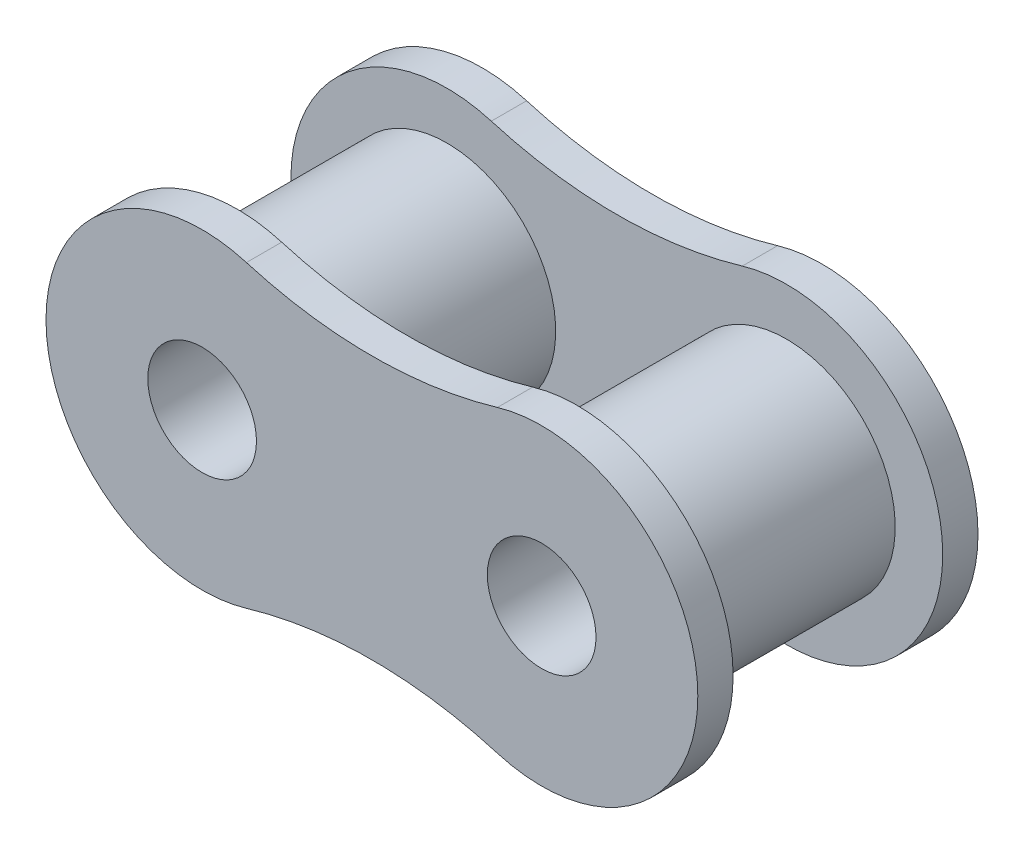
ISO-10303-21;
HEADER;
FILE_DESCRIPTION(('STEP AP214'),'2;1');
FILE_NAME('part.step','',(''),(''),'','','');
FILE_SCHEMA(('AUTOMOTIVE_DESIGN { 1 0 10303 214 1 1 1 1 }'));
ENDSEC;
DATA;
#1=APPLICATION_CONTEXT('core data for automotive mechanical design processes');
#2=APPLICATION_PROTOCOL_DEFINITION('international standard','automotive_design',2000,#1);
#3=PRODUCT_CONTEXT('',#1,'mechanical');
#4=PRODUCT('Part','Part','',(#3));
#5=PRODUCT_RELATED_PRODUCT_CATEGORY('part','',(#4));
#6=PRODUCT_DEFINITION_FORMATION('','',#4);
#7=PRODUCT_DEFINITION_CONTEXT('part definition',#1,'design');
#8=PRODUCT_DEFINITION('design','',#6,#7);
#9=PRODUCT_DEFINITION_SHAPE('','',#8);
#10=(LENGTH_UNIT() NAMED_UNIT(*) SI_UNIT(.MILLI.,.METRE.));
#11=(NAMED_UNIT(*) PLANE_ANGLE_UNIT() SI_UNIT($,.RADIAN.));
#12=(NAMED_UNIT(*) SI_UNIT($,.STERADIAN.) SOLID_ANGLE_UNIT());
#13=UNCERTAINTY_MEASURE_WITH_UNIT(LENGTH_MEASURE(1.E-05),#10,'distance_accuracy_value','');
#14=(GEOMETRIC_REPRESENTATION_CONTEXT(3) GLOBAL_UNCERTAINTY_ASSIGNED_CONTEXT((#13)) GLOBAL_UNIT_ASSIGNED_CONTEXT((#10,
#11,#12)) REPRESENTATION_CONTEXT('',''));
#15=CARTESIAN_POINT('',(0.,0.,0.));
#16=DIRECTION('',(0.,0.,1.));
#17=DIRECTION('',(1.,0.,0.));
#18=AXIS2_PLACEMENT_3D('',#15,#16,#17);
#19=CARTESIAN_POINT('',(-3.96875,13.4204712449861,4.9));
#20=DIRECTION('',(0.,0.,1.));
#21=DIRECTION('',(1.,0.,0.));
#22=AXIS2_PLACEMENT_3D('',#19,#20,#21);
#23=PLANE('',#22);
#24=CARTESIAN_POINT('',(0.,0.,4.9));
#25=DIRECTION('',(0.,0.,1.));
#26=DIRECTION('',(1.,0.,0.));
#27=AXIS2_PLACEMENT_3D('',#24,#25,#26);
#28=CIRCLE('',#27,5.08);
#29=CARTESIAN_POINT('',(5.08,0.,4.9));
#30=VERTEX_POINT('',#29);
#31=EDGE_CURVE('E42',#30,#30,#28,.T.);
#32=ORIENTED_EDGE('',*,*,#31,.T.);
#33=EDGE_LOOP('',(#32));
#34=FACE_BOUND('',#33,.T.);
#35=CARTESIAN_POINT('',(-7.9375,26.8409424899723,4.9));
#36=DIRECTION('',(0.,0.,-1.));
#37=DIRECTION('',(1.,0.,0.));
#38=AXIS2_PLACEMENT_3D('',#35,#36,#37);
#39=CIRCLE('',#38,20.69);
#40=CARTESIAN_POINT('',(-2.07015898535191,7.00031726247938,4.9));
#41=VERTEX_POINT('',#40);
#42=CARTESIAN_POINT('',(-13.8048410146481,7.00031726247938,4.9));
#43=VERTEX_POINT('',#42);
#44=EDGE_CURVE('E152',#41,#43,#39,.T.);
#45=ORIENTED_EDGE('',*,*,#44,.F.);
#46=CARTESIAN_POINT('',(0.,0.,4.9));
#47=DIRECTION('',(0.,0.,1.));
#48=DIRECTION('',(1.,0.,0.));
#49=AXIS2_PLACEMENT_3D('',#46,#47,#48);
#50=CIRCLE('',#49,7.3);
#51=CARTESIAN_POINT('',(-2.07015898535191,-7.00031726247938,4.9));
#52=VERTEX_POINT('',#51);
#53=EDGE_CURVE('E74',#52,#41,#50,.T.);
#54=ORIENTED_EDGE('',*,*,#53,.F.);
#55=CARTESIAN_POINT('',(-7.9375,-26.8409424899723,4.9));
#56=DIRECTION('',(0.,0.,-1.));
#57=DIRECTION('',(-1.,0.,0.));
#58=AXIS2_PLACEMENT_3D('',#55,#56,#57);
#59=CIRCLE('',#58,20.69);
#60=CARTESIAN_POINT('',(-13.8048410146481,-7.00031726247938,4.9));
#61=VERTEX_POINT('',#60);
#62=EDGE_CURVE('E68',#61,#52,#59,.T.);
#63=ORIENTED_EDGE('',*,*,#62,.F.);
#64=CARTESIAN_POINT('',(-15.875,0.,4.9));
#65=DIRECTION('',(0.,0.,1.));
#66=DIRECTION('',(1.,0.,0.));
#67=AXIS2_PLACEMENT_3D('',#64,#65,#66);
#68=CIRCLE('',#67,7.3);
#69=EDGE_CURVE('E162',#43,#61,#68,.T.);
#70=ORIENTED_EDGE('',*,*,#69,.F.);
#71=EDGE_LOOP('',(#45,#54,#63,#70));
#72=FACE_BOUND('',#71,.T.);
#73=CARTESIAN_POINT('',(-15.875,0.,4.9));
#74=DIRECTION('',(0.,0.,1.));
#75=DIRECTION('',(1.,0.,0.));
#76=AXIS2_PLACEMENT_3D('',#73,#74,#75);
#77=CIRCLE('',#76,5.08);
#78=CARTESIAN_POINT('',(-10.795,0.,4.9));
#79=VERTEX_POINT('',#78);
#80=EDGE_CURVE('E11',#79,#79,#77,.F.);
#81=ORIENTED_EDGE('',*,*,#80,.F.);
#82=EDGE_LOOP('',(#81));
#83=FACE_BOUND('',#82,.T.);
#84=ADVANCED_FACE('F33',(#34,#72,#83),#23,.F.);
#85=CARTESIAN_POINT('',(0.,0.,4.9));
#86=DIRECTION('',(0.,0.,-1.));
#87=DIRECTION('',(-1.,0.,0.));
#88=AXIS2_PLACEMENT_3D('',#85,#86,#87);
#89=CYLINDRICAL_SURFACE('',#88,5.08);
#90=ORIENTED_EDGE('',*,*,#31,.F.);
#91=EDGE_LOOP('',(#90));
#92=FACE_BOUND('',#91,.T.);
#93=CARTESIAN_POINT('',(0.,0.,-4.9));
#94=DIRECTION('',(0.,0.,-1.));
#95=DIRECTION('',(-1.,0.,0.));
#96=AXIS2_PLACEMENT_3D('',#93,#94,#95);
#97=CIRCLE('',#96,5.08);
#98=CARTESIAN_POINT('',(-5.08,0.,-4.9));
#99=VERTEX_POINT('',#98);
#100=EDGE_CURVE('E138',#99,#99,#97,.T.);
#101=ORIENTED_EDGE('',*,*,#100,.F.);
#102=EDGE_LOOP('',(#101));
#103=FACE_BOUND('',#102,.T.);
#104=ADVANCED_FACE('F35',(#92,#103),#89,.T.);
#105=CARTESIAN_POINT('',(0.,0.,4.9));
#106=DIRECTION('',(0.,0.,-1.));
#107=DIRECTION('',(-1.,0.,0.));
#108=AXIS2_PLACEMENT_3D('',#105,#106,#107);
#109=CYLINDRICAL_SURFACE('',#108,2.54);
#110=CARTESIAN_POINT('',(0.,0.,6.55));
#111=DIRECTION('',(0.,0.,1.));
#112=DIRECTION('',(1.,0.,0.));
#113=AXIS2_PLACEMENT_3D('',#110,#111,#112);
#114=CIRCLE('',#113,2.54);
#115=CARTESIAN_POINT('',(2.54,0.,6.55));
#116=VERTEX_POINT('',#115);
#117=EDGE_CURVE('E149',#116,#116,#114,.T.);
#118=ORIENTED_EDGE('',*,*,#117,.T.);
#119=EDGE_LOOP('',(#118));
#120=FACE_BOUND('',#119,.T.);
#121=CARTESIAN_POINT('',(0.,0.,-6.55));
#122=DIRECTION('',(0.,0.,-1.));
#123=DIRECTION('',(-1.,0.,0.));
#124=AXIS2_PLACEMENT_3D('',#121,#122,#123);
#125=CIRCLE('',#124,2.54);
#126=CARTESIAN_POINT('',(-2.54,0.,-6.55));
#127=VERTEX_POINT('',#126);
#128=EDGE_CURVE('E228',#127,#127,#125,.T.);
#129=ORIENTED_EDGE('',*,*,#128,.T.);
#130=EDGE_LOOP('',(#129));
#131=FACE_BOUND('',#130,.T.);
#132=ADVANCED_FACE('F179',(#120,#131),#109,.F.);
#133=CARTESIAN_POINT('',(-3.96875,13.4204712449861,6.55));
#134=DIRECTION('',(0.,0.,1.));
#135=DIRECTION('',(1.,0.,0.));
#136=AXIS2_PLACEMENT_3D('',#133,#134,#135);
#137=PLANE('',#136);
#138=ORIENTED_EDGE('',*,*,#117,.F.);
#139=EDGE_LOOP('',(#138));
#140=FACE_BOUND('',#139,.T.);
#141=CARTESIAN_POINT('',(-7.9375,26.8409424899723,6.55));
#142=DIRECTION('',(0.,0.,-1.));
#143=DIRECTION('',(1.,0.,0.));
#144=AXIS2_PLACEMENT_3D('',#141,#142,#143);
#145=CIRCLE('',#144,20.69);
#146=CARTESIAN_POINT('',(-2.07015898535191,7.00031726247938,6.55));
#147=VERTEX_POINT('',#146);
#148=CARTESIAN_POINT('',(-13.8048410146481,7.00031726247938,6.55));
#149=VERTEX_POINT('',#148);
#150=EDGE_CURVE('E153',#147,#149,#145,.T.);
#151=ORIENTED_EDGE('',*,*,#150,.T.);
#152=CARTESIAN_POINT('',(-15.875,0.,6.55));
#153=DIRECTION('',(0.,0.,1.));
#154=DIRECTION('',(1.,0.,0.));
#155=AXIS2_PLACEMENT_3D('',#152,#153,#154);
#156=CIRCLE('',#155,7.3);
#157=CARTESIAN_POINT('',(-13.8048410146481,-7.00031726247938,6.55));
#158=VERTEX_POINT('',#157);
#159=EDGE_CURVE('E82',#149,#158,#156,.T.);
#160=ORIENTED_EDGE('',*,*,#159,.T.);
#161=CARTESIAN_POINT('',(-7.9375,-26.8409424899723,6.55));
#162=DIRECTION('',(0.,0.,-1.));
#163=DIRECTION('',(-1.,0.,0.));
#164=AXIS2_PLACEMENT_3D('',#161,#162,#163);
#165=CIRCLE('',#164,20.69);
#166=CARTESIAN_POINT('',(-2.07015898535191,-7.00031726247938,6.55));
#167=VERTEX_POINT('',#166);
#168=EDGE_CURVE('E156',#158,#167,#165,.T.);
#169=ORIENTED_EDGE('',*,*,#168,.T.);
#170=CARTESIAN_POINT('',(0.,0.,6.55));
#171=DIRECTION('',(0.,0.,1.));
#172=DIRECTION('',(1.,0.,0.));
#173=AXIS2_PLACEMENT_3D('',#170,#171,#172);
#174=CIRCLE('',#173,7.3);
#175=EDGE_CURVE('E50',#167,#147,#174,.T.);
#176=ORIENTED_EDGE('',*,*,#175,.T.);
#177=EDGE_LOOP('',(#151,#160,#169,#176));
#178=FACE_BOUND('',#177,.T.);
#179=CARTESIAN_POINT('',(-15.875,0.,6.55));
#180=DIRECTION('',(0.,0.,1.));
#181=DIRECTION('',(1.,0.,0.));
#182=AXIS2_PLACEMENT_3D('',#179,#180,#181);
#183=CIRCLE('',#182,2.54);
#184=CARTESIAN_POINT('',(-13.335,0.,6.55));
#185=VERTEX_POINT('',#184);
#186=EDGE_CURVE('E146',#185,#185,#183,.T.);
#187=ORIENTED_EDGE('',*,*,#186,.F.);
#188=EDGE_LOOP('',(#187));
#189=FACE_BOUND('',#188,.T.);
#190=ADVANCED_FACE('F204',(#140,#178,#189),#137,.T.);
#191=CARTESIAN_POINT('',(-7.9375,26.8409424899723,6.55));
#192=DIRECTION('',(0.,0.,-1.));
#193=DIRECTION('',(-1.,0.,0.));
#194=AXIS2_PLACEMENT_3D('',#191,#192,#193);
#195=CYLINDRICAL_SURFACE('',#194,20.69);
#196=ORIENTED_EDGE('',*,*,#44,.T.);
#197=DIRECTION('',(0.,0.,-1.));
#198=VECTOR('',#197,1.);
#199=CARTESIAN_POINT('',(-13.8048410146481,7.00031726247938,6.55));
#200=LINE('',#199,#198);
#201=EDGE_CURVE('E171',#149,#43,#200,.T.);
#202=ORIENTED_EDGE('',*,*,#201,.F.);
#203=ORIENTED_EDGE('',*,*,#150,.F.);
#204=DIRECTION('',(0.,0.,-1.));
#205=VECTOR('',#204,1.);
#206=CARTESIAN_POINT('',(-2.07015898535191,7.00031726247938,6.55));
#207=LINE('',#206,#205);
#208=EDGE_CURVE('E159',#147,#41,#207,.T.);
#209=ORIENTED_EDGE('',*,*,#208,.T.);
#210=EDGE_LOOP('',(#196,#202,#203,#209));
#211=FACE_BOUND('',#210,.T.);
#212=ADVANCED_FACE('F215',(#211),#195,.F.);
#213=CARTESIAN_POINT('',(-15.875,0.,6.55));
#214=DIRECTION('',(0.,0.,-1.));
#215=DIRECTION('',(-1.,0.,0.));
#216=AXIS2_PLACEMENT_3D('',#213,#214,#215);
#217=CYLINDRICAL_SURFACE('',#216,7.3);
#218=ORIENTED_EDGE('',*,*,#69,.T.);
#219=DIRECTION('',(0.,0.,-1.));
#220=VECTOR('',#219,1.);
#221=CARTESIAN_POINT('',(-13.8048410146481,-7.00031726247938,6.55));
#222=LINE('',#221,#220);
#223=EDGE_CURVE('E169',#158,#61,#222,.T.);
#224=ORIENTED_EDGE('',*,*,#223,.F.);
#225=ORIENTED_EDGE('',*,*,#159,.F.);
#226=ORIENTED_EDGE('',*,*,#201,.T.);
#227=EDGE_LOOP('',(#218,#224,#225,#226));
#228=FACE_BOUND('',#227,.T.);
#229=ADVANCED_FACE('F212',(#228),#217,.T.);
#230=CARTESIAN_POINT('',(-7.9375,-26.8409424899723,6.55));
#231=DIRECTION('',(0.,0.,-1.));
#232=DIRECTION('',(-1.,0.,0.));
#233=AXIS2_PLACEMENT_3D('',#230,#231,#232);
#234=CYLINDRICAL_SURFACE('',#233,20.69);
#235=ORIENTED_EDGE('',*,*,#62,.T.);
#236=DIRECTION('',(0.,0.,-1.));
#237=VECTOR('',#236,1.);
#238=CARTESIAN_POINT('',(-2.07015898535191,-7.00031726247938,6.55));
#239=LINE('',#238,#237);
#240=EDGE_CURVE('E167',#167,#52,#239,.T.);
#241=ORIENTED_EDGE('',*,*,#240,.F.);
#242=ORIENTED_EDGE('',*,*,#168,.F.);
#243=ORIENTED_EDGE('',*,*,#223,.T.);
#244=EDGE_LOOP('',(#235,#241,#242,#243));
#245=FACE_BOUND('',#244,.T.);
#246=ADVANCED_FACE('F209',(#245),#234,.F.);
#247=CARTESIAN_POINT('',(0.,0.,6.55));
#248=DIRECTION('',(0.,0.,-1.));
#249=DIRECTION('',(-1.,0.,0.));
#250=AXIS2_PLACEMENT_3D('',#247,#248,#249);
#251=CYLINDRICAL_SURFACE('',#250,7.3);
#252=ORIENTED_EDGE('',*,*,#53,.T.);
#253=ORIENTED_EDGE('',*,*,#208,.F.);
#254=ORIENTED_EDGE('',*,*,#175,.F.);
#255=ORIENTED_EDGE('',*,*,#240,.T.);
#256=EDGE_LOOP('',(#252,#253,#254,#255));
#257=FACE_BOUND('',#256,.T.);
#258=ADVANCED_FACE('F206',(#257),#251,.T.);
#259=CARTESIAN_POINT('',(-15.875,0.,6.55));
#260=DIRECTION('',(0.,0.,-1.));
#261=DIRECTION('',(-1.,0.,0.));
#262=AXIS2_PLACEMENT_3D('',#259,#260,#261);
#263=CYLINDRICAL_SURFACE('',#262,2.54);
#264=ORIENTED_EDGE('',*,*,#186,.T.);
#265=EDGE_LOOP('',(#264));
#266=FACE_BOUND('',#265,.T.);
#267=CARTESIAN_POINT('',(-15.875,0.,-6.55));
#268=DIRECTION('',(0.,0.,-1.));
#269=DIRECTION('',(-1.,0.,0.));
#270=AXIS2_PLACEMENT_3D('',#267,#268,#269);
#271=CIRCLE('',#270,2.54);
#272=CARTESIAN_POINT('',(-18.415,0.,-6.55));
#273=VERTEX_POINT('',#272);
#274=EDGE_CURVE('E229',#273,#273,#271,.T.);
#275=ORIENTED_EDGE('',*,*,#274,.T.);
#276=EDGE_LOOP('',(#275));
#277=FACE_BOUND('',#276,.T.);
#278=ADVANCED_FACE('F193',(#266,#277),#263,.F.);
#279=CARTESIAN_POINT('',(-15.875,0.,4.9));
#280=DIRECTION('',(0.,0.,-1.));
#281=DIRECTION('',(-1.,0.,0.));
#282=AXIS2_PLACEMENT_3D('',#279,#280,#281);
#283=CYLINDRICAL_SURFACE('',#282,5.08);
#284=ORIENTED_EDGE('',*,*,#80,.T.);
#285=EDGE_LOOP('',(#284));
#286=FACE_BOUND('',#285,.T.);
#287=CARTESIAN_POINT('',(-15.875,0.,-4.9));
#288=DIRECTION('',(0.,0.,-1.));
#289=DIRECTION('',(-1.,0.,0.));
#290=AXIS2_PLACEMENT_3D('',#287,#288,#289);
#291=CIRCLE('',#290,5.08);
#292=CARTESIAN_POINT('',(-20.955,0.,-4.9));
#293=VERTEX_POINT('',#292);
#294=EDGE_CURVE('E135',#293,#293,#291,.T.);
#295=ORIENTED_EDGE('',*,*,#294,.F.);
#296=EDGE_LOOP('',(#295));
#297=FACE_BOUND('',#296,.T.);
#298=ADVANCED_FACE('F184',(#286,#297),#283,.T.);
#299=CARTESIAN_POINT('',(-11.90625,13.4204712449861,-4.9));
#300=DIRECTION('',(0.,0.,-1.));
#301=DIRECTION('',(-1.,0.,0.));
#302=AXIS2_PLACEMENT_3D('',#299,#300,#301);
#303=PLANE('',#302);
#304=ORIENTED_EDGE('',*,*,#294,.T.);
#305=EDGE_LOOP('',(#304));
#306=FACE_BOUND('',#305,.T.);
#307=CARTESIAN_POINT('',(-7.9375,26.8409424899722,-4.9));
#308=DIRECTION('',(0.,0.,1.));
#309=DIRECTION('',(-1.,0.,0.));
#310=AXIS2_PLACEMENT_3D('',#307,#308,#309);
#311=CIRCLE('',#310,20.6899999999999);
#312=CARTESIAN_POINT('',(-13.8048410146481,7.00031726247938,-4.9));
#313=VERTEX_POINT('',#312);
#314=CARTESIAN_POINT('',(-2.07015898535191,7.00031726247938,-4.9));
#315=VERTEX_POINT('',#314);
#316=EDGE_CURVE('E134',#313,#315,#311,.T.);
#317=ORIENTED_EDGE('',*,*,#316,.F.);
#318=CARTESIAN_POINT('',(-15.875,0.,-4.9));
#319=DIRECTION('',(0.,0.,-1.));
#320=DIRECTION('',(-1.,0.,0.));
#321=AXIS2_PLACEMENT_3D('',#318,#319,#320);
#322=CIRCLE('',#321,7.3);
#323=CARTESIAN_POINT('',(-13.8048410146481,-7.00031726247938,-4.9));
#324=VERTEX_POINT('',#323);
#325=EDGE_CURVE('E130',#324,#313,#322,.T.);
#326=ORIENTED_EDGE('',*,*,#325,.F.);
#327=CARTESIAN_POINT('',(-7.93749999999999,-26.8409424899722,-4.9));
#328=DIRECTION('',(0.,0.,1.));
#329=DIRECTION('',(1.,0.,0.));
#330=AXIS2_PLACEMENT_3D('',#327,#328,#329);
#331=CIRCLE('',#330,20.6899999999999);
#332=CARTESIAN_POINT('',(-2.07015898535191,-7.00031726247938,-4.9));
#333=VERTEX_POINT('',#332);
#334=EDGE_CURVE('E240',#333,#324,#331,.T.);
#335=ORIENTED_EDGE('',*,*,#334,.F.);
#336=CARTESIAN_POINT('',(0.,0.,-4.9));
#337=DIRECTION('',(0.,0.,-1.));
#338=DIRECTION('',(-1.,0.,0.));
#339=AXIS2_PLACEMENT_3D('',#336,#337,#338);
#340=CIRCLE('',#339,7.3);
#341=EDGE_CURVE('E231',#315,#333,#340,.T.);
#342=ORIENTED_EDGE('',*,*,#341,.F.);
#343=EDGE_LOOP('',(#317,#326,#335,#342));
#344=FACE_BOUND('',#343,.T.);
#345=ORIENTED_EDGE('',*,*,#100,.T.);
#346=EDGE_LOOP('',(#345));
#347=FACE_BOUND('',#346,.T.);
#348=ADVANCED_FACE('F182',(#306,#344,#347),#303,.F.);
#349=CARTESIAN_POINT('',(-11.90625,13.4204712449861,-6.55));
#350=DIRECTION('',(0.,0.,-1.));
#351=DIRECTION('',(-1.,0.,0.));
#352=AXIS2_PLACEMENT_3D('',#349,#350,#351);
#353=PLANE('',#352);
#354=ORIENTED_EDGE('',*,*,#128,.F.);
#355=EDGE_LOOP('',(#354));
#356=FACE_BOUND('',#355,.T.);
#357=CARTESIAN_POINT('',(-7.9375,26.8409424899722,-6.55));
#358=DIRECTION('',(0.,0.,1.));
#359=DIRECTION('',(-1.,0.,0.));
#360=AXIS2_PLACEMENT_3D('',#357,#358,#359);
#361=CIRCLE('',#360,20.6899999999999);
#362=CARTESIAN_POINT('',(-13.8048410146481,7.00031726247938,-6.55));
#363=VERTEX_POINT('',#362);
#364=CARTESIAN_POINT('',(-2.07015898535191,7.00031726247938,-6.55));
#365=VERTEX_POINT('',#364);
#366=EDGE_CURVE('E120',#363,#365,#361,.T.);
#367=ORIENTED_EDGE('',*,*,#366,.T.);
#368=CARTESIAN_POINT('',(0.,0.,-6.55));
#369=DIRECTION('',(0.,0.,-1.));
#370=DIRECTION('',(-1.,0.,0.));
#371=AXIS2_PLACEMENT_3D('',#368,#369,#370);
#372=CIRCLE('',#371,7.3);
#373=CARTESIAN_POINT('',(-2.07015898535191,-7.00031726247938,-6.55));
#374=VERTEX_POINT('',#373);
#375=EDGE_CURVE('E109',#365,#374,#372,.T.);
#376=ORIENTED_EDGE('',*,*,#375,.T.);
#377=CARTESIAN_POINT('',(-7.93749999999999,-26.8409424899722,-6.55));
#378=DIRECTION('',(0.,0.,1.));
#379=DIRECTION('',(1.,0.,0.));
#380=AXIS2_PLACEMENT_3D('',#377,#378,#379);
#381=CIRCLE('',#380,20.6899999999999);
#382=CARTESIAN_POINT('',(-13.8048410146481,-7.00031726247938,-6.55));
#383=VERTEX_POINT('',#382);
#384=EDGE_CURVE('E119',#374,#383,#381,.T.);
#385=ORIENTED_EDGE('',*,*,#384,.T.);
#386=CARTESIAN_POINT('',(-15.875,0.,-6.55));
#387=DIRECTION('',(0.,0.,-1.));
#388=DIRECTION('',(-1.,0.,0.));
#389=AXIS2_PLACEMENT_3D('',#386,#387,#388);
#390=CIRCLE('',#389,7.3);
#391=EDGE_CURVE('E126',#383,#363,#390,.T.);
#392=ORIENTED_EDGE('',*,*,#391,.T.);
#393=EDGE_LOOP('',(#367,#376,#385,#392));
#394=FACE_BOUND('',#393,.T.);
#395=ORIENTED_EDGE('',*,*,#274,.F.);
#396=EDGE_LOOP('',(#395));
#397=FACE_BOUND('',#396,.T.);
#398=ADVANCED_FACE('F123',(#356,#394,#397),#353,.T.);
#399=CARTESIAN_POINT('',(-7.9375,26.8409424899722,-6.55));
#400=DIRECTION('',(0.,0.,1.));
#401=DIRECTION('',(1.,0.,0.));
#402=AXIS2_PLACEMENT_3D('',#399,#400,#401);
#403=CYLINDRICAL_SURFACE('',#402,20.6899999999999);
#404=ORIENTED_EDGE('',*,*,#316,.T.);
#405=DIRECTION('',(0.,0.,1.));
#406=VECTOR('',#405,1.);
#407=CARTESIAN_POINT('',(-2.07015898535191,7.00031726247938,-6.55));
#408=LINE('',#407,#406);
#409=EDGE_CURVE('E113',#365,#315,#408,.T.);
#410=ORIENTED_EDGE('',*,*,#409,.F.);
#411=ORIENTED_EDGE('',*,*,#366,.F.);
#412=DIRECTION('',(0.,0.,1.));
#413=VECTOR('',#412,1.);
#414=CARTESIAN_POINT('',(-13.8048410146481,7.00031726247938,-6.55));
#415=LINE('',#414,#413);
#416=EDGE_CURVE('E237',#363,#313,#415,.T.);
#417=ORIENTED_EDGE('',*,*,#416,.T.);
#418=EDGE_LOOP('',(#404,#410,#411,#417));
#419=FACE_BOUND('',#418,.T.);
#420=ADVANCED_FACE('F132',(#419),#403,.F.);
#421=CARTESIAN_POINT('',(0.,0.,-6.55));
#422=DIRECTION('',(0.,0.,1.));
#423=DIRECTION('',(1.,0.,0.));
#424=AXIS2_PLACEMENT_3D('',#421,#422,#423);
#425=CYLINDRICAL_SURFACE('',#424,7.3);
#426=ORIENTED_EDGE('',*,*,#341,.T.);
#427=DIRECTION('',(0.,0.,1.));
#428=VECTOR('',#427,1.);
#429=CARTESIAN_POINT('',(-2.07015898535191,-7.00031726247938,-6.55));
#430=LINE('',#429,#428);
#431=EDGE_CURVE('E116',#374,#333,#430,.T.);
#432=ORIENTED_EDGE('',*,*,#431,.F.);
#433=ORIENTED_EDGE('',*,*,#375,.F.);
#434=ORIENTED_EDGE('',*,*,#409,.T.);
#435=EDGE_LOOP('',(#426,#432,#433,#434));
#436=FACE_BOUND('',#435,.T.);
#437=ADVANCED_FACE('F111',(#436),#425,.T.);
#438=CARTESIAN_POINT('',(-7.93749999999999,-26.8409424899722,-6.55));
#439=DIRECTION('',(0.,0.,1.));
#440=DIRECTION('',(1.,0.,0.));
#441=AXIS2_PLACEMENT_3D('',#438,#439,#440);
#442=CYLINDRICAL_SURFACE('',#441,20.6899999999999);
#443=ORIENTED_EDGE('',*,*,#334,.T.);
#444=DIRECTION('',(0.,0.,1.));
#445=VECTOR('',#444,1.);
#446=CARTESIAN_POINT('',(-13.8048410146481,-7.00031726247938,-6.55));
#447=LINE('',#446,#445);
#448=EDGE_CURVE('E140',#383,#324,#447,.T.);
#449=ORIENTED_EDGE('',*,*,#448,.F.);
#450=ORIENTED_EDGE('',*,*,#384,.F.);
#451=ORIENTED_EDGE('',*,*,#431,.T.);
#452=EDGE_LOOP('',(#443,#449,#450,#451));
#453=FACE_BOUND('',#452,.T.);
#454=ADVANCED_FACE('F250',(#453),#442,.F.);
#455=CARTESIAN_POINT('',(-15.875,0.,-6.55));
#456=DIRECTION('',(0.,0.,1.));
#457=DIRECTION('',(1.,0.,0.));
#458=AXIS2_PLACEMENT_3D('',#455,#456,#457);
#459=CYLINDRICAL_SURFACE('',#458,7.3);
#460=ORIENTED_EDGE('',*,*,#325,.T.);
#461=ORIENTED_EDGE('',*,*,#416,.F.);
#462=ORIENTED_EDGE('',*,*,#391,.F.);
#463=ORIENTED_EDGE('',*,*,#448,.T.);
#464=EDGE_LOOP('',(#460,#461,#462,#463));
#465=FACE_BOUND('',#464,.T.);
#466=ADVANCED_FACE('F247',(#465),#459,.T.);
#467=CLOSED_SHELL('',(#84,#104,#132,#190,#212,#229,#246,#258,#278,#298,#348,#398,#420,#437,#454,#466));
#468=MANIFOLD_SOLID_BREP('B2',#467);
#469=ADVANCED_BREP_SHAPE_REPRESENTATION('',(#18,#468),#14);
#470=SHAPE_DEFINITION_REPRESENTATION(#9,#469);
ENDSEC;
END-ISO-10303-21;
